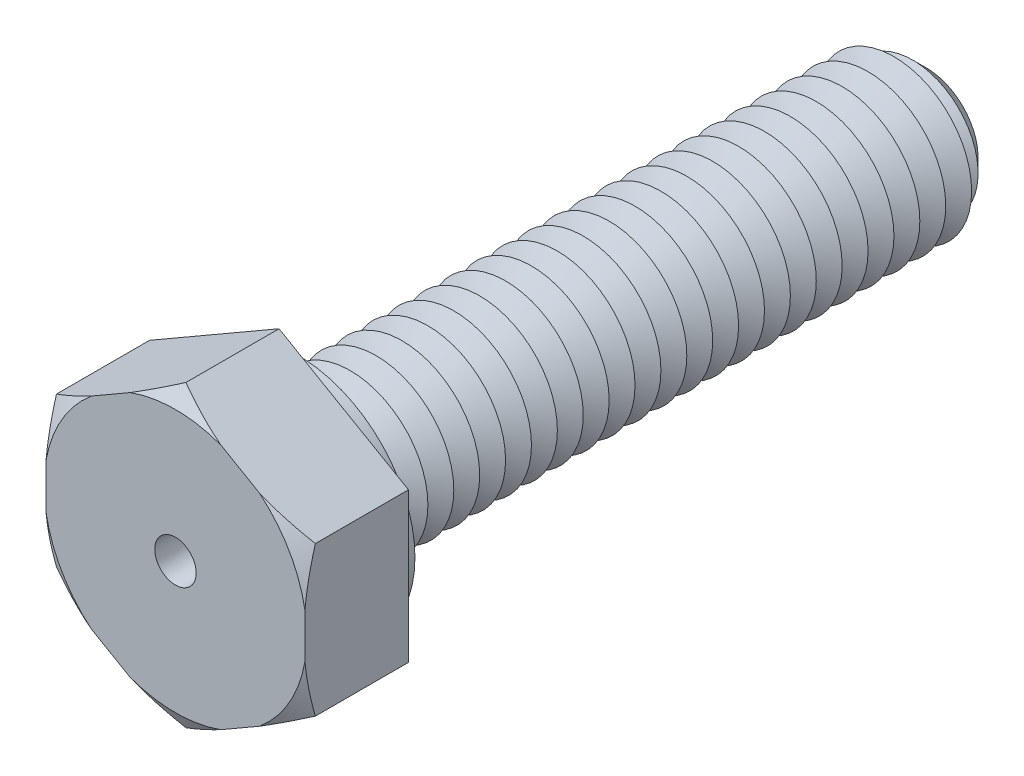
from build123d import *

# Parameters (mm, degrees)
BOSS_EXTRUDE1_DEPTH = 4
SKETCH3_R           = 3
BOSS_EXTRUDE2_DEPTH = 25
SKETCH4_R           = 4.5
BOSS_EXTRUDE3_DEPTH = 0.75
CHAMFER1_SIZE       = 1
LPATTERN1_COUNT     = 24
LPATTERN1_PITCH     = 1
SKETCH8_R           = 0.8
CUT_EXTRUDE1_DEPTH  = 29


with BuildPart() as part:
    # Sketch2 → Boss-Extrude1 (new body)
    with BuildSketch(Plane.XY):
        Polygon((0, 5.773502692), (-5, 2.886751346), (-5, -2.886751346), (0, -5.773502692), (5, -2.886751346), (5, 2.886751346), align=None)
    extrude(amount=BOSS_EXTRUDE1_DEPTH)

    # Sketch3 → Boss-Extrude2 (add)
    with BuildSketch(Plane(origin=(0, 0, 0), x_dir=(-1, 0, 0), z_dir=(0, 0, -1))):
        Circle(SKETCH3_R)
    extrude(amount=BOSS_EXTRUDE2_DEPTH)

    # Sketch4 → Boss-Extrude3 (add)
    with BuildSketch(Plane(origin=(0, 0, 0), x_dir=(-1, 0, 0), z_dir=(0, 0, -1))):
        with Locations(Location((0, 0, 0), (0, 0, 180))):
            Circle(SKETCH4_R)
    extrude(amount=BOSS_EXTRUDE3_DEPTH)

    # Chamfer1
    chamfer1_edges = [part.edges().sort_by_distance(p)[0] for p in [
        (3, 0, -25),
    ]]
    chamfer(chamfer1_edges, length=CHAMFER1_SIZE)

    # Sketch6 → Cut-Revolve1 (revolve, cut)
    with BuildSketch(Plane(origin=(0, 0, 0), x_dir=(0, 0, -1), z_dir=(1, 0, 0)), mode=Mode.PRIVATE) as cut_revolve1_sk:
        Polygon((0.75, 3), (1.25, 2.133974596), (1.75, 3), align=None)
    cut_revolve1 = revolve(cut_revolve1_sk.sketch.rotate(Axis((0, 0, 3.211670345), (0, 0, -1)), 90), axis=Axis((0, 0, 3.211670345), (0, 0, -1)), mode=Mode.SUBTRACT)

    # LPattern1: Cut-Revolve1 ×24
    with Locations(*[(0, 0, -i * LPATTERN1_PITCH) for i in range(1, LPATTERN1_COUNT)]):
        add(cut_revolve1, mode=Mode.SUBTRACT)

    # Sketch7 → Cut-Revolve2 (revolve, cut)
    with BuildSketch(Plane(origin=(0, 0, 0), x_dir=(0, 0, -1), z_dir=(1, 0, 0)), mode=Mode.PRIVATE) as cut_revolve2_sk:
        Polygon((-4, 5.773502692), (-4, 5.073502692), (-3.595854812, 5.773502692), align=None)
    revolve(cut_revolve2_sk.sketch.rotate(Axis((0, 0, 3.211670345), (0, 0, -1)), 270), axis=Axis((0, 0, 3.211670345), (0, 0, -1)), mode=Mode.SUBTRACT)

    # Sketch8 → Cut-Extrude1 (cut)
    with BuildSketch(Plane.XY.offset(4)):
        Circle(SKETCH8_R)
    extrude(amount=-CUT_EXTRUDE1_DEPTH, mode=Mode.SUBTRACT)


solid = part.part
